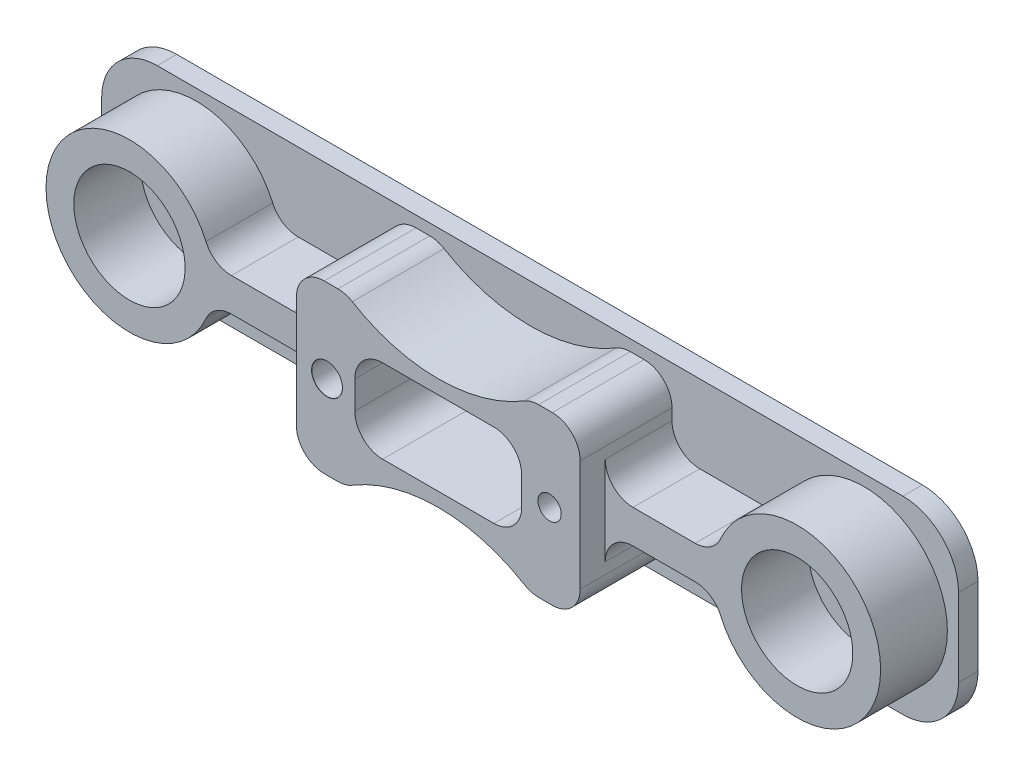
from build123d import *

# Parameters (mm, degrees)
AUFSATZ_LINEAR_AUSTRAGEN1_DEPTH = 3.5
AUFSATZ_LINEAR_AUSTRAGEN2_DEPTH = 16.5
SKIZZE3_R                       = 30
SCHNITT_LINEAR_AUSTRAGEN2_DEPTH = 16.5
VERRUNDUNG1_R                   = 5
SKIZZE4_R                       = 10
AUFSATZ_LINEAR_AUSTRAGEN3_DEPTH = 12
VERRUNDUNG2_R                   = 5
M5_GEWINDEBOHRUNG1_D            = 4.2
M5_GEWINDEBOHRUNG1_DEPTH        = 17
M5_GEWINDEBOHRUNG1_TIP          = 1.2618073


with BuildPart() as part:
    # Skizze1 → Aufsatz-Linear austragen1 (new body)
    with BuildSketch(Plane.XY):
        with BuildLine():
            Line((67, -17), (-67, -17))
            ThreePointArc((-67, -17), (-74.071067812, -14.071067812), (-77, -7))
            Line((-77, -7), (-77, 7))
            ThreePointArc((-77, 7), (-74.071067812, 14.071067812), (-67, 17))
            Line((-67, 17), (67, 17))
            ThreePointArc((67, 17), (74.071067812, 14.071067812), (77, 7))
            Line((77, 7), (77, -7))
            ThreePointArc((77, -7), (74.071067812, -14.071067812), (67, -17))
        make_face()
    extrude(amount=AUFSATZ_LINEAR_AUSTRAGEN1_DEPTH)

    # Skizze2 → Aufsatz-Linear austragen2 (add)
    with BuildSketch(Plane.XY.offset(3.5)):
        with BuildLine():
            Line((-20.5, -15), (20.5, -15))
            ThreePointArc((20.5, -15), (24.035533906, -13.535533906), (25.5, -10))
            Line((25.5, -10), (25.5, 10))
            ThreePointArc((25.5, 10), (24.035533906, 13.535533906), (20.5, 15))
            Line((20.5, 15), (-20.5, 15))
            ThreePointArc((-20.5, 15), (-24.035533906, 13.535533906), (-25.5, 10))
            Line((-25.5, 10), (-25.5, -10))
            ThreePointArc((-25.5, -10), (-24.035533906, -13.535533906), (-20.5, -15))
        make_face()
        with BuildLine():
            Line((-10, 7.5), (10, 7.5))
            ThreePointArc((10, 7.5), (13.535533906, 6.035533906), (15, 2.5))
            Line((15, 2.5), (15, -2.5))
            ThreePointArc((15, -2.5), (13.535533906, -6.035533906), (10, -7.5))
            Line((10, -7.5), (-10, -7.5))
            ThreePointArc((-10, -7.5), (-13.535533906, -6.035533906), (-15, -2.5))
            Line((-15, -2.5), (-15, 2.5))
            ThreePointArc((-15, 2.5), (-13.535533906, 6.035533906), (-10, 7.5))
        make_face(mode=Mode.SUBTRACT)
    extrude(amount=AUFSATZ_LINEAR_AUSTRAGEN2_DEPTH)

    # Skizze3 → Schnitt-Linear austragen2 (cut)
    with BuildSketch(Plane.XY.offset(20)):
        with Locations((0, -40)):
            Circle(SKIZZE3_R)
        with Locations((0, 40)):
            Circle(SKIZZE3_R)
    extrude(amount=-SCHNITT_LINEAR_AUSTRAGEN2_DEPTH, mode=Mode.SUBTRACT)

    # Verrundung1
    verrundung1_edges = [part.edges().sort_by_distance(p)[0] for p in [
        (16.583123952, -15, 11.75),
        (-16.583123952, -15, 11.75),
        (-16.583123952, 15, 11.75),
        (16.583123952, 15, 11.75),
    ]]
    fillet(verrundung1_edges, radius=VERRUNDUNG1_R)

    # Skizze4 → Aufsatz-Linear austragen3 (add)
    # profile 1 of 2: a face of its own
    with BuildSketch(Plane.XY.offset(3.5)):
        with BuildLine():
            Line((-25.5, 3), (-45.303061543, 3))
            ThreePointArc((-45.303061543, 3), (-75, 0), (-45.303061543, -3))
            Line((-45.303061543, -3), (-25.5, -3))
            Line((-25.5, -3), (-25.5, 3))
        make_face()
        with Locations((-60, 0)):
            Circle(SKIZZE4_R, mode=Mode.SUBTRACT)
    # profile 2 of 2: a face of its own
    with BuildSketch(Plane.XY.offset(3.5)):
        with BuildLine():
            Line((25.5, 3), (25.5, -3))
            Line((25.5, -3), (45.303061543, -3))
            ThreePointArc((45.303061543, -3), (75, 0), (45.303061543, 3))
            Line((45.303061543, 3), (25.5, 3))
        make_face()
        with Locations(Location((60, 0, 0), (0, 0, 180))):
            Circle(SKIZZE4_R, mode=Mode.SUBTRACT)
    extrude(amount=AUFSATZ_LINEAR_AUSTRAGEN3_DEPTH)

    # Verrundung2
    verrundung2_edges = [part.edges().sort_by_distance(p)[0] for p in [
        (-25.5, -3, 9.5),
        (-25.5, 3, 9.5),
        (-45.303061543, 3, 9.5),
        (-45.303061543, -3, 9.5),
        (45.303061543, -3, 9.5),
        (45.303061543, 3, 9.5),
        (25.5, 3, 9.5),
        (25.5, -3, 9.5),
    ]]
    fillet(verrundung2_edges, radius=VERRUNDUNG2_R)

    # Skizze5 → Formsenkung f_r M5 Senkschraube mit Inne (revolve, cut)
    with BuildSketch(Plane.YZ.offset(-20)):
        Polygon((0, 0), (0, 20), (2.775, 20), (2.75, 19.975), (2.75, 2.95), (5.2, 0.5), (5.2, 0), align=None)
    revolve(axis=Axis((-20, 0, -6.35), (0, 0, 1)), mode=Mode.SUBTRACT)

    # M5 Gewindebohrung1
    with Locations(Plane.XY.offset(20)):
        with Locations((20, 0)):
            Hole(M5_GEWINDEBOHRUNG1_D / 2, depth=M5_GEWINDEBOHRUNG1_DEPTH)
            with Locations((0, 0, -(M5_GEWINDEBOHRUNG1_DEPTH + M5_GEWINDEBOHRUNG1_TIP / 2))):  # 118° drill point
                Cone(0, M5_GEWINDEBOHRUNG1_D / 2, M5_GEWINDEBOHRUNG1_TIP, mode=Mode.SUBTRACT)


solid = part.part
